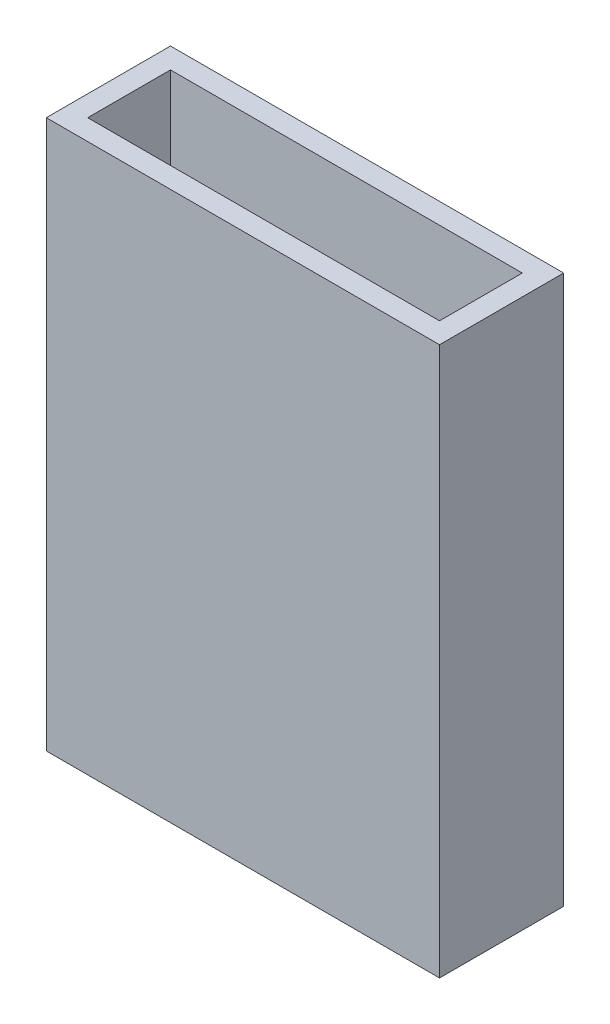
from build123d import *

# Parameters (mm, degrees)
CROQUIS1_W                 = 38
CROQUIS1_H                 = 12
SALIENTE_EXTRUIR1_DEPTH    = 3
CROQUIS2_W                 = 38
CROQUIS2_H                 = 12
CROQUIS2_W_2               = 34
CROQUIS2_H_2               = 8
SALIENTE_EXTRUIR2_DEPTH    = 50
CORTAR_EXTRUIR1_DEPTH      = 54.823786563
CORTAR_EXTRUIR1_DEPTH_BACK = 54.823786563
CROQUIS3_R                 = 1.5


with BuildPart() as part:
    # Croquis1 → Saliente-Extruir1 (new body)
    with BuildSketch(Plane(origin=(0, 0, 0), x_dir=(1, 0, 0), z_dir=(0, 1, 0))):
        Rectangle(CROQUIS1_W, CROQUIS1_H)
    extrude(amount=SALIENTE_EXTRUIR1_DEPTH)

    # Croquis2 → Saliente-Extruir2 (add)
    with BuildSketch(Plane(origin=(0, 3, 0), x_dir=(1, 0, 0), z_dir=(0, 1, 0))):
        Rectangle(CROQUIS2_W, CROQUIS2_H)
        Rectangle(CROQUIS2_W_2, CROQUIS2_H_2, mode=Mode.SUBTRACT)
    extrude(amount=SALIENTE_EXTRUIR2_DEPTH)

    # Croquis3 → Cortar-Extruir1 (cut, two sides: drawn at the far end of the back side and taken through both)
    with BuildSketch(Plane(origin=(0, 3, 0), x_dir=(1, 0, 0), z_dir=(0, 1, 0)).offset(-CORTAR_EXTRUIR1_DEPTH_BACK)):
        with Locations(Location((-12.5, 0, 0), (0, 0, 270))):
            Circle(CROQUIS3_R)
        with Locations(Location((12.5, 0, 0), (0, 0, 270))):
            Circle(CROQUIS3_R)
    extrude(amount=CORTAR_EXTRUIR1_DEPTH + CORTAR_EXTRUIR1_DEPTH_BACK, mode=Mode.SUBTRACT)


solid = part.part
